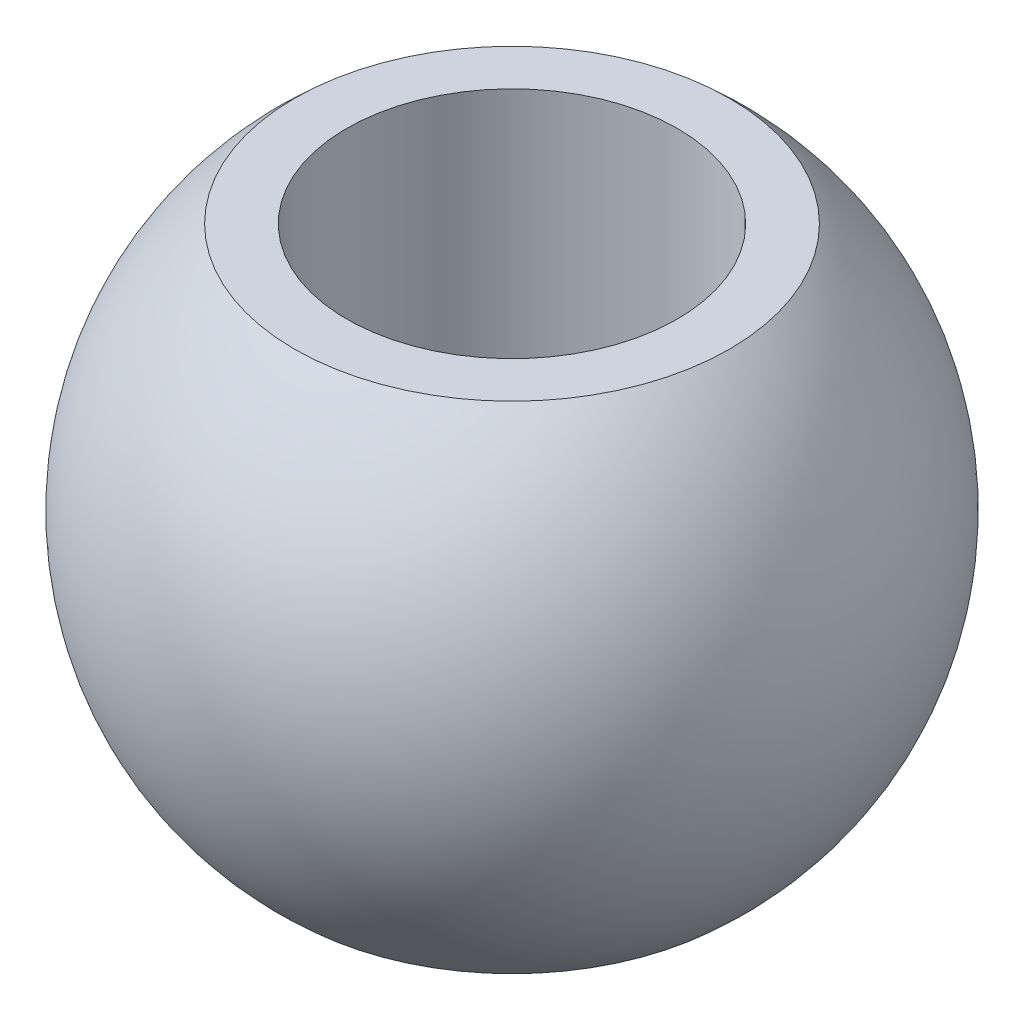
from build123d import *


with BuildPart() as part:
    # Sketch1 → Revolve1 (revolve)
    with BuildSketch(Plane.XY):
        with BuildLine():
            Line((-4, 6), (-4, -6))
            Line((-4, -6), (-5.261216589, -6))
            ThreePointArc((-5.261216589, -6), (-7.98, 0), (-5.261216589, 6))
            Line((-5.261216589, 6), (-4, 6))
        make_face()
    revolve(axis=Axis((0, 0, 0), (0, 1, 0)))


solid = part.part
